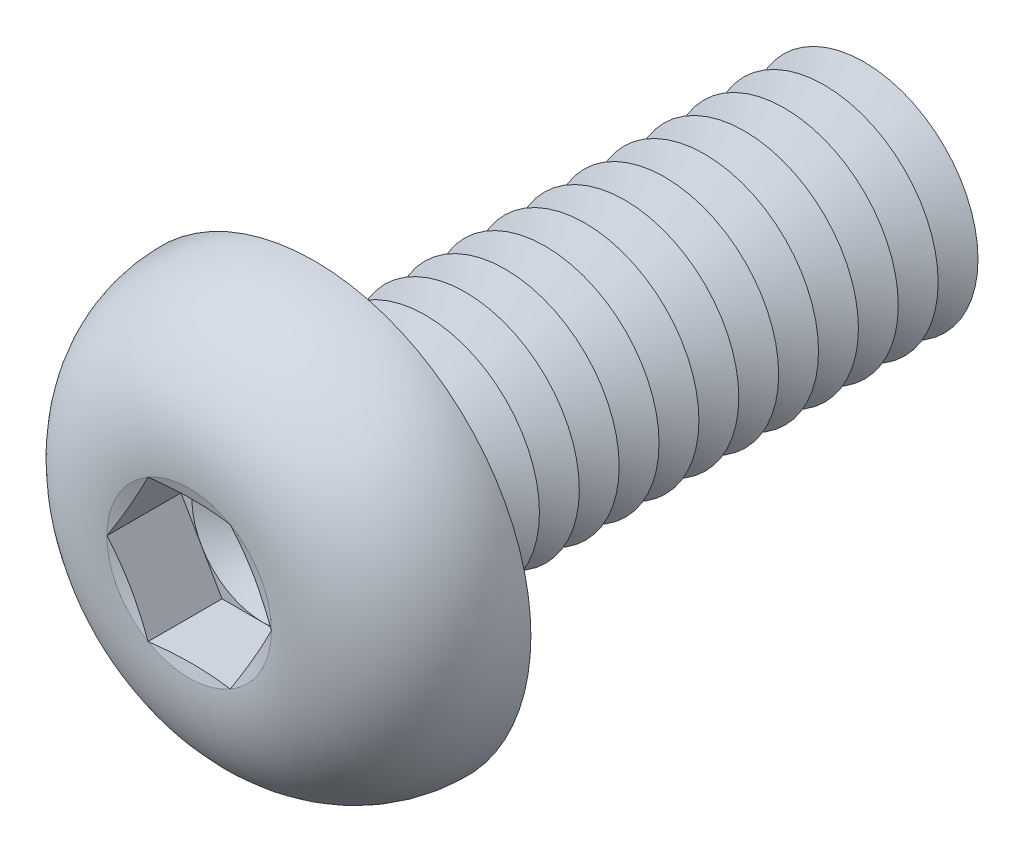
from build123d import *

# Parameters (mm, degrees)
FILLET1_R          = 0.35
LPATTERN1_COUNT    = 14
LPATTERN1_PITCH    = 0.7
CUT_EXTRUDE1_DEPTH = 1.3


with BuildPart() as part:
    # Sketch1 → Revolve1 (revolve)
    with BuildSketch(Plane(origin=(0, 0, 0), x_dir=(0, 0, -1), z_dir=(1, 0, 0)), mode=Mode.PRIVATE) as revolve1_sk:
        with BuildLine():
            Line((0, 2), (0, 3.8))
            ThreePointArc((0, 3.8), (-1.611961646, 3.099623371), (-2.2, 1.443375))
            Line((-2.2, 1.443375), (-2.006624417, 0.7216875))
            Line((-2.006624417, 0.7216875), (-2.2, 0.7216875))
            Line((-2.2, 0.7216875), (-2.2, 0))
            Line((-2.2, 0), (10, 0))
            Line((10, 0), (10, 2))
            Line((10, 2), (0, 2))
        make_face()
    revolve(revolve1_sk.sketch.rotate(Axis((0, 0, -10), (0, 0, 1)), 90), axis=Axis((0, 0, -10), (0, 0, 1)))

    # Fillet1
    fillet1_edges = [part.edges().sort_by_distance(p)[0] for p in [
        (2, 0, 0),
    ]]
    fillet(fillet1_edges, radius=FILLET1_R)

    # Sketch2 → Cut-Revolve1 (revolve, cut)
    with BuildSketch(Plane(origin=(0, 0, 0), x_dir=(0, 0, -1), z_dir=(1, 0, 0)), mode=Mode.PRIVATE) as cut_revolve1_sk:
        Polygon((9.65, 2), (10.35, 2), (10, 1.393782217), align=None)
    cut_revolve1 = revolve(cut_revolve1_sk.sketch.rotate(Axis((0, 0, -10), (0, 0, -1)), 270), axis=Axis((0, 0, -10), (0, 0, -1)), mode=Mode.SUBTRACT)

    # LPattern1: Cut-Revolve1 ×14
    with Locations(*[(0, 0, i * LPATTERN1_PITCH) for i in range(1, LPATTERN1_COUNT)]):
        add(cut_revolve1, mode=Mode.SUBTRACT)

    # Sketch3 → Cut-Extrude1 (cut)
    with BuildSketch(Plane.XY.offset(2.2)):
        Polygon((0.7216875, 1.249999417), (-0.7216875, 1.249999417), (-1.443375, 0), (-0.7216875, -1.249999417), (0.7216875, -1.249999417), (1.443375, 0), align=None)
    extrude(amount=-CUT_EXTRUDE1_DEPTH, mode=Mode.SUBTRACT)

    # Cut-Extrude2 cone 1 section (on through the dimple's axis) → Cut-Extrude2 (revolve, cut)
    with BuildSketch(Plane(origin=(0, 0, 0.9), x_dir=(0, -1, 0), z_dir=(1, 0, 0))):
        Polygon((0, 0), (1.249999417, 0), (0, 0.7216875), align=None)
    revolve(axis=Axis((0, 0, 0.9), (0, 0, -1)), mode=Mode.SUBTRACT)


solid = part.part
